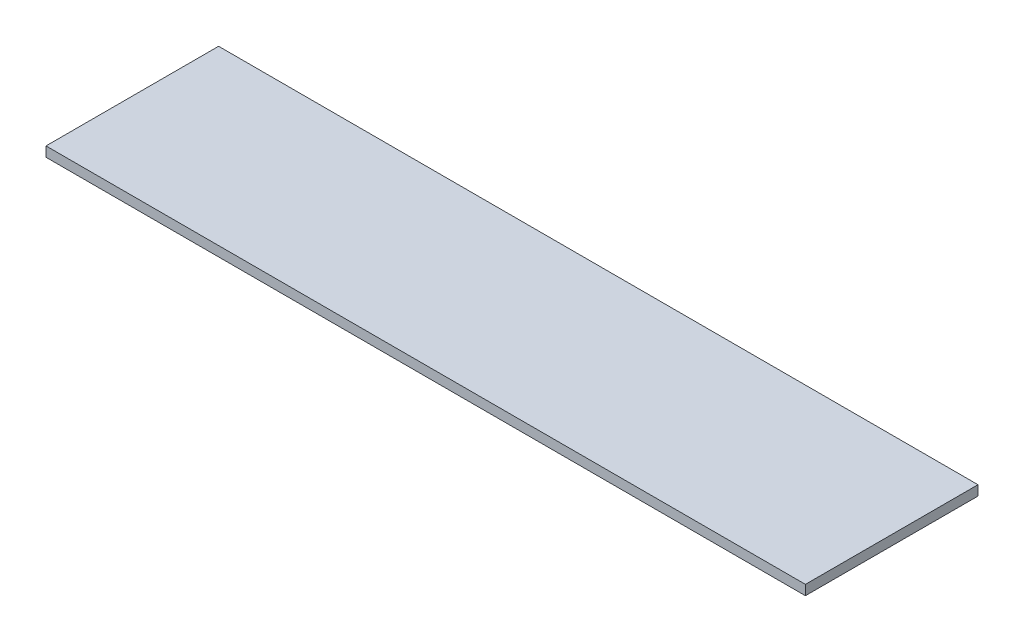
from build123d import *

# Parameters (mm, degrees)
ESQUISSE1_W        = 1540
ESQUISSE1_H        = 350
BOSS_EXTRU_1_DEPTH = 10


with BuildPart() as part:
    # Esquisse1 → Boss.-Extru.1 (new, symmetric)
    with BuildSketch(Plane(origin=(0, 0, 0), x_dir=(1, 0, 0), z_dir=(0, 1, 0))):
        Rectangle(ESQUISSE1_W, ESQUISSE1_H)
    extrude(amount=BOSS_EXTRU_1_DEPTH, both=True)


solid = part.part
